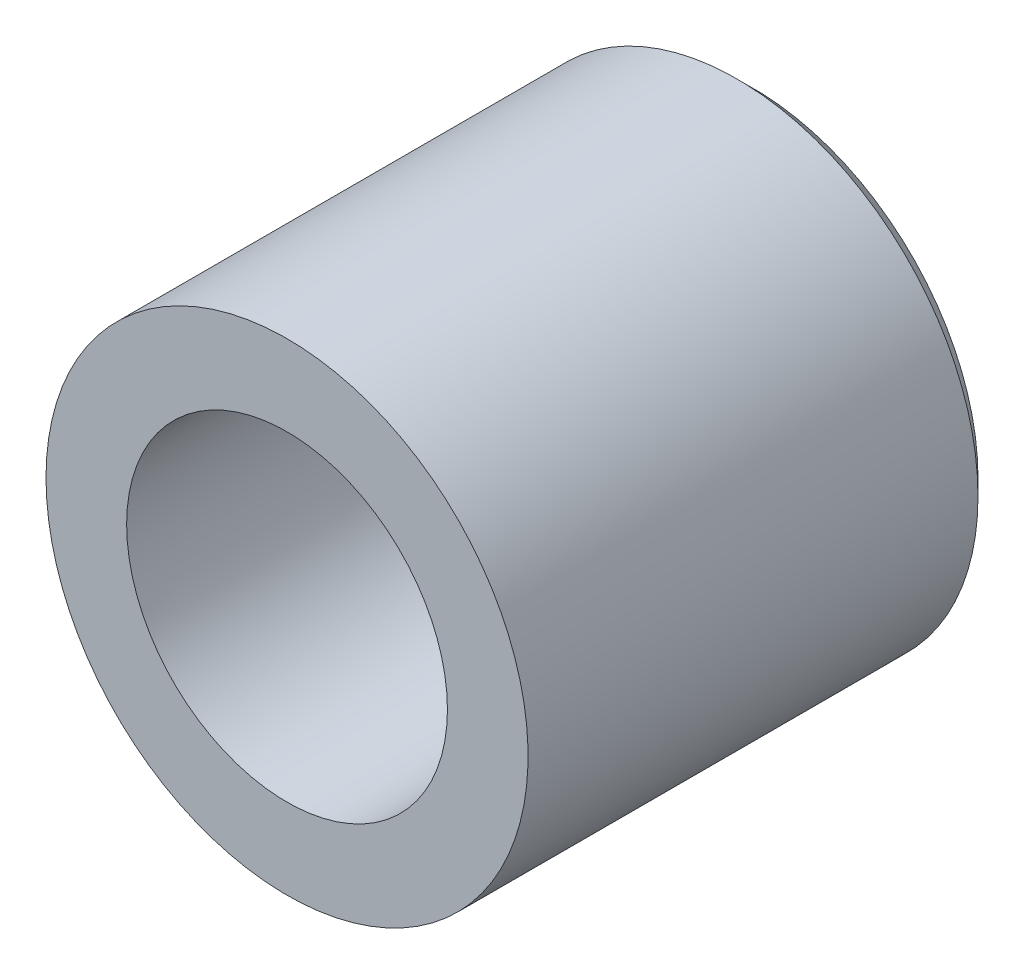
ISO-10303-21;
HEADER;
FILE_DESCRIPTION(('STEP AP214'),'2;1');
FILE_NAME('part.step','',(''),(''),'','','');
FILE_SCHEMA(('AUTOMOTIVE_DESIGN { 1 0 10303 214 1 1 1 1 }'));
ENDSEC;
DATA;
#1=APPLICATION_CONTEXT('core data for automotive mechanical design processes');
#2=APPLICATION_PROTOCOL_DEFINITION('international standard','automotive_design',2000,#1);
#3=PRODUCT_CONTEXT('',#1,'mechanical');
#4=PRODUCT('Part','Part','',(#3));
#5=PRODUCT_RELATED_PRODUCT_CATEGORY('part','',(#4));
#6=PRODUCT_DEFINITION_FORMATION('','',#4);
#7=PRODUCT_DEFINITION_CONTEXT('part definition',#1,'design');
#8=PRODUCT_DEFINITION('design','',#6,#7);
#9=PRODUCT_DEFINITION_SHAPE('','',#8);
#10=(LENGTH_UNIT() NAMED_UNIT(*) SI_UNIT(.MILLI.,.METRE.));
#11=(NAMED_UNIT(*) PLANE_ANGLE_UNIT() SI_UNIT($,.RADIAN.));
#12=(NAMED_UNIT(*) SI_UNIT($,.STERADIAN.) SOLID_ANGLE_UNIT());
#13=UNCERTAINTY_MEASURE_WITH_UNIT(LENGTH_MEASURE(1.E-05),#10,'distance_accuracy_value','');
#14=(GEOMETRIC_REPRESENTATION_CONTEXT(3) GLOBAL_UNCERTAINTY_ASSIGNED_CONTEXT((#13)) GLOBAL_UNIT_ASSIGNED_CONTEXT((#10,
#11,#12)) REPRESENTATION_CONTEXT('',''));
#15=CARTESIAN_POINT('',(0.,0.,0.));
#16=DIRECTION('',(0.,0.,1.));
#17=DIRECTION('',(1.,0.,0.));
#18=AXIS2_PLACEMENT_3D('',#15,#16,#17);
#19=CARTESIAN_POINT('',(0.,0.,-12.9663162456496));
#20=DIRECTION('',(0.,0.,1.));
#21=DIRECTION('',(1.,0.,0.));
#22=AXIS2_PLACEMENT_3D('',#19,#20,#21);
#23=CONICAL_SURFACE('',#22,13.7718577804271,0.785398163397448);
#24=CARTESIAN_POINT('',(-1.25693328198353E-13,0.,-18.));
#25=DIRECTION('',(0.,0.,1.));
#26=DIRECTION('',(-1.,0.,0.));
#27=AXIS2_PLACEMENT_3D('',#24,#25,#26);
#28=CIRCLE('',#27,8.73817402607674);
#29=CARTESIAN_POINT('',(8.73817402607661,0.,-18.));
#30=VERTEX_POINT('',#29);
#31=CARTESIAN_POINT('',(-8.73817402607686,0.,-18.));
#32=VERTEX_POINT('',#31);
#33=EDGE_CURVE('E143',#30,#32,#28,.T.);
#34=ORIENTED_EDGE('',*,*,#33,.F.);
#35=CARTESIAN_POINT('',(8.73817451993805,0.,-17.9999995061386));
#36=CARTESIAN_POINT('',(9.73817237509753,0.,-17.0000016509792));
#37=B_SPLINE_CURVE_WITH_KNOTS('',1,(#35,#36),.UNSPECIFIED.,.F.,.F.,(2,2),(0.634494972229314,
0.70710666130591),.UNSPECIFIED.);
#38=CARTESIAN_POINT('',(9.73817402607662,0.,-17.));
#39=VERTEX_POINT('',#38);
#40=EDGE_CURVE('E44',#30,#39,#37,.T.);
#41=ORIENTED_EDGE('',*,*,#40,.T.);
#42=CARTESIAN_POINT('',(-1.18710365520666E-13,0.,-17.));
#43=DIRECTION('',(0.,0.,-1.));
#44=DIRECTION('',(-1.,0.,0.));
#45=AXIS2_PLACEMENT_3D('',#42,#43,#44);
#46=CIRCLE('',#45,9.73817402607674);
#47=CARTESIAN_POINT('',(-9.73817402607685,0.,-17.));
#48=VERTEX_POINT('',#47);
#49=EDGE_CURVE('E11',#48,#39,#46,.T.);
#50=ORIENTED_EDGE('',*,*,#49,.F.);
#51=CARTESIAN_POINT('',(-1.18710365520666E-13,0.,-17.));
#52=DIRECTION('',(0.,0.,-1.));
#53=DIRECTION('',(-1.,0.,0.));
#54=AXIS2_PLACEMENT_3D('',#51,#52,#53);
#55=CIRCLE('',#54,9.73817402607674);
#56=EDGE_CURVE('E51',#39,#48,#55,.T.);
#57=ORIENTED_EDGE('',*,*,#56,.F.);
#58=ORIENTED_EDGE('',*,*,#40,.F.);
#59=CARTESIAN_POINT('',(-1.25693328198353E-13,0.,-18.));
#60=DIRECTION('',(0.,0.,1.));
#61=DIRECTION('',(-1.,0.,0.));
#62=AXIS2_PLACEMENT_3D('',#59,#60,#61);
#63=CIRCLE('',#62,8.73817402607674);
#64=EDGE_CURVE('E59',#32,#30,#63,.T.);
#65=ORIENTED_EDGE('',*,*,#64,.F.);
#66=EDGE_LOOP('',(#34,#41,#50,#57,#58,#65));
#67=FACE_BOUND('',#66,.T.);
#68=ADVANCED_FACE('F36',(#67),#23,.F.);
#69=CARTESIAN_POINT('',(-1.15218884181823E-13,0.,-16.5));
#70=DIRECTION('',(0.,0.,-1.));
#71=DIRECTION('',(-1.,0.,0.));
#72=AXIS2_PLACEMENT_3D('',#69,#70,#71);
#73=CYLINDRICAL_SURFACE('',#72,9.73817402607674);
#74=CARTESIAN_POINT('',(-1.04744440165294E-13,0.,-15.));
#75=DIRECTION('',(0.,0.,-1.));
#76=DIRECTION('',(-1.,0.,0.));
#77=AXIS2_PLACEMENT_3D('',#74,#75,#76);
#78=CIRCLE('',#77,9.73817402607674);
#79=CARTESIAN_POINT('',(-9.73817402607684,0.,-15.));
#80=VERTEX_POINT('',#79);
#81=EDGE_CURVE('E152',#80,#80,#78,.T.);
#82=ORIENTED_EDGE('',*,*,#81,.F.);
#83=CARTESIAN_POINT('',(-9.73817402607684,0.,-14.9999969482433));
#84=CARTESIAN_POINT('',(-9.73817402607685,0.,-17.0000020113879));
#85=B_SPLINE_CURVE_WITH_KNOTS('',1,(#83,#84),.UNSPECIFIED.,.F.,.F.,(2,2),(0.0833320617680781,
0.91666750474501),.UNSPECIFIED.);
#86=EDGE_CURVE('E147',#80,#48,#85,.T.);
#87=ORIENTED_EDGE('',*,*,#86,.T.);
#88=ORIENTED_EDGE('',*,*,#49,.T.);
#89=ORIENTED_EDGE('',*,*,#56,.T.);
#90=ORIENTED_EDGE('',*,*,#86,.F.);
#91=EDGE_LOOP('',(#82,#87,#88,#89,#90));
#92=FACE_BOUND('',#91,.T.);
#93=ADVANCED_FACE('F191',(#92),#73,.F.);
#94=CARTESIAN_POINT('',(20.0978002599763,-18.1619536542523,-18.));
#95=DIRECTION('',(0.,0.,-1.));
#96=DIRECTION('',(-1.,0.,0.));
#97=AXIS2_PLACEMENT_3D('',#94,#95,#96);
#98=PLANE('',#97);
#99=CARTESIAN_POINT('',(-2.09488880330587E-13,0.,-17.9999999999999));
#100=DIRECTION('',(0.,0.,-1.));
#101=DIRECTION('',(-1.,0.,0.));
#102=AXIS2_PLACEMENT_3D('',#99,#100,#101);
#103=CIRCLE('',#102,4.24999999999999);
#104=CARTESIAN_POINT('',(-4.2500000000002,0.,-17.9999999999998));
#105=VERTEX_POINT('',#104);
#106=EDGE_CURVE('E103',#105,#105,#103,.T.);
#107=ORIENTED_EDGE('',*,*,#106,.T.);
#108=EDGE_LOOP('',(#107));
#109=FACE_BOUND('',#108,.T.);
#110=ORIENTED_EDGE('',*,*,#64,.T.);
#111=ORIENTED_EDGE('',*,*,#33,.T.);
#112=EDGE_LOOP('',(#110,#111));
#113=FACE_BOUND('',#112,.T.);
#114=ADVANCED_FACE('F193',(#109,#113),#98,.F.);
#115=CARTESIAN_POINT('',(0.,0.,-1.));
#116=DIRECTION('',(0.,0.,1.));
#117=DIRECTION('',(-1.,0.,0.));
#118=AXIS2_PLACEMENT_3D('',#115,#116,#117);
#119=CONICAL_SURFACE('',#118,9.98254493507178,0.0174532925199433);
#120=ORIENTED_EDGE('',*,*,#81,.T.);
#121=CARTESIAN_POINT('',(-9.73817402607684,0.,-15.));
#122=CARTESIAN_POINT('',(-9.98254493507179,0.,-0.99999999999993));
#123=B_SPLINE_CURVE_WITH_KNOTS('',1,(#121,#122),.UNSPECIFIED.,.F.,.F.,(2,2),(0.,1.),.UNSPECIFIED.);
#124=CARTESIAN_POINT('',(-9.98254493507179,0.,-0.99999999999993));
#125=VERTEX_POINT('',#124);
#126=EDGE_CURVE('E108',#80,#125,#123,.T.);
#127=ORIENTED_EDGE('',*,*,#126,.T.);
#128=CARTESIAN_POINT('',(0.,0.,-1.));
#129=DIRECTION('',(0.,0.,-1.));
#130=DIRECTION('',(1.,0.,0.));
#131=AXIS2_PLACEMENT_3D('',#128,#129,#130);
#132=CIRCLE('',#131,9.98254493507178);
#133=CARTESIAN_POINT('',(9.98254493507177,0.,-1.00000000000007));
#134=VERTEX_POINT('',#133);
#135=EDGE_CURVE('E133',#134,#125,#132,.T.);
#136=ORIENTED_EDGE('',*,*,#135,.F.);
#137=CARTESIAN_POINT('',(0.,0.,-1.));
#138=DIRECTION('',(0.,0.,-1.));
#139=DIRECTION('',(1.,0.,0.));
#140=AXIS2_PLACEMENT_3D('',#137,#138,#139);
#141=CIRCLE('',#140,9.98254493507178);
#142=EDGE_CURVE('E126',#125,#134,#141,.T.);
#143=ORIENTED_EDGE('',*,*,#142,.F.);
#144=ORIENTED_EDGE('',*,*,#126,.F.);
#145=EDGE_LOOP('',(#120,#127,#136,#143,#144));
#146=FACE_BOUND('',#145,.T.);
#147=ADVANCED_FACE('F189',(#146),#119,.F.);
#148=CARTESIAN_POINT('',(-1.5911934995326E-13,0.,-22.7867965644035));
#149=DIRECTION('',(0.,0.,1.));
#150=DIRECTION('',(1.,0.,0.));
#151=AXIS2_PLACEMENT_3D('',#148,#149,#150);
#152=CONICAL_SURFACE('',#151,21.2132034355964,0.785398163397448);
#153=CARTESIAN_POINT('',(-2.09488880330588E-13,0.,-30.));
#154=DIRECTION('',(0.,0.,1.));
#155=DIRECTION('',(-1.,0.,0.));
#156=AXIS2_PLACEMENT_3D('',#153,#154,#155);
#157=CIRCLE('',#156,14.);
#158=CARTESIAN_POINT('',(-14.0000000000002,0.,-30.));
#159=VERTEX_POINT('',#158);
#160=CARTESIAN_POINT('',(13.9999999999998,0.,-30.));
#161=VERTEX_POINT('',#160);
#162=EDGE_CURVE('E90',#159,#161,#157,.T.);
#163=ORIENTED_EDGE('',*,*,#162,.T.);
#164=CARTESIAN_POINT('',(14.0000009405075,0.,-29.9999990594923));
#165=CARTESIAN_POINT('',(15.0000023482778,0.,-28.9999976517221));
#166=B_SPLINE_CURVE_WITH_KNOTS('',1,(#164,#165),.UNSPECIFIED.,.F.,.F.,(2,2),(0.659966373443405,
0.707106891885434),.UNSPECIFIED.);
#167=CARTESIAN_POINT('',(14.9999999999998,0.,-29.));
#168=VERTEX_POINT('',#167);
#169=EDGE_CURVE('E95',#161,#168,#166,.T.);
#170=ORIENTED_EDGE('',*,*,#169,.T.);
#171=CARTESIAN_POINT('',(-2.02505917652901E-13,0.,-29.));
#172=DIRECTION('',(0.,0.,-1.));
#173=DIRECTION('',(-1.,0.,0.));
#174=AXIS2_PLACEMENT_3D('',#171,#172,#173);
#175=CIRCLE('',#174,15.);
#176=CARTESIAN_POINT('',(-15.,0.,-29.));
#177=VERTEX_POINT('',#176);
#178=EDGE_CURVE('E102',#168,#177,#175,.T.);
#179=ORIENTED_EDGE('',*,*,#178,.T.);
#180=CARTESIAN_POINT('',(-2.02505917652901E-13,0.,-29.));
#181=DIRECTION('',(0.,0.,-1.));
#182=DIRECTION('',(-1.,0.,0.));
#183=AXIS2_PLACEMENT_3D('',#180,#181,#182);
#184=CIRCLE('',#183,15.);
#185=EDGE_CURVE('E105',#177,#168,#184,.T.);
#186=ORIENTED_EDGE('',*,*,#185,.T.);
#187=ORIENTED_EDGE('',*,*,#169,.F.);
#188=CARTESIAN_POINT('',(-2.09488880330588E-13,0.,-30.));
#189=DIRECTION('',(0.,0.,1.));
#190=DIRECTION('',(-1.,0.,0.));
#191=AXIS2_PLACEMENT_3D('',#188,#189,#190);
#192=CIRCLE('',#191,14.);
#193=EDGE_CURVE('E97',#161,#159,#192,.T.);
#194=ORIENTED_EDGE('',*,*,#193,.T.);
#195=EDGE_LOOP('',(#163,#170,#179,#186,#187,#194));
#196=FACE_BOUND('',#195,.T.);
#197=ADVANCED_FACE('F92',(#196),#152,.T.);
#198=CARTESIAN_POINT('',(-1.08235921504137E-13,0.,-15.5));
#199=DIRECTION('',(0.,0.,-1.));
#200=DIRECTION('',(-1.,0.,0.));
#201=AXIS2_PLACEMENT_3D('',#198,#199,#200);
#202=CYLINDRICAL_SURFACE('',#201,15.);
#203=CARTESIAN_POINT('',(0.,0.,-1.));
#204=DIRECTION('',(0.,0.,1.));
#205=DIRECTION('',(-1.,0.,0.));
#206=AXIS2_PLACEMENT_3D('',#203,#204,#205);
#207=CIRCLE('',#206,15.);
#208=CARTESIAN_POINT('',(-15.,0.,-0.999999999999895));
#209=VERTEX_POINT('',#208);
#210=EDGE_CURVE('E99',#209,#209,#207,.T.);
#211=ORIENTED_EDGE('',*,*,#210,.F.);
#212=CARTESIAN_POINT('',(-15.,0.,-0.99999893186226));
#213=CARTESIAN_POINT('',(-15.,0.,-28.9999996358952));
#214=B_SPLINE_CURVE_WITH_KNOTS('',1,(#212,#213),.UNSPECIFIED.,.F.,.F.,(2,2),(0.0833333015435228,
0.916666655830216),.UNSPECIFIED.);
#215=EDGE_CURVE('E173',#209,#177,#214,.T.);
#216=ORIENTED_EDGE('',*,*,#215,.T.);
#217=ORIENTED_EDGE('',*,*,#178,.F.);
#218=ORIENTED_EDGE('',*,*,#185,.F.);
#219=ORIENTED_EDGE('',*,*,#215,.F.);
#220=EDGE_LOOP('',(#211,#216,#217,#218,#219));
#221=FACE_BOUND('',#220,.T.);
#222=ADVANCED_FACE('F225',(#221),#202,.T.);
#223=CARTESIAN_POINT('',(32.2,-29.0984535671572,-30.));
#224=DIRECTION('',(0.,0.,-1.));
#225=DIRECTION('',(-1.,0.,0.));
#226=AXIS2_PLACEMENT_3D('',#223,#224,#225);
#227=PLANE('',#226);
#228=CARTESIAN_POINT('',(-2.09488880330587E-13,0.,-29.9999999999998));
#229=DIRECTION('',(0.,0.,-1.));
#230=DIRECTION('',(-1.,0.,0.));
#231=AXIS2_PLACEMENT_3D('',#228,#229,#230);
#232=CIRCLE('',#231,4.24999999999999);
#233=CARTESIAN_POINT('',(-4.2500000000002,0.,-29.9999999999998));
#234=VERTEX_POINT('',#233);
#235=EDGE_CURVE('E275',#234,#234,#232,.T.);
#236=ORIENTED_EDGE('',*,*,#235,.F.);
#237=EDGE_LOOP('',(#236));
#238=FACE_BOUND('',#237,.T.);
#239=ORIENTED_EDGE('',*,*,#193,.F.);
#240=ORIENTED_EDGE('',*,*,#162,.F.);
#241=EDGE_LOOP('',(#239,#240));
#242=FACE_BOUND('',#241,.T.);
#243=ADVANCED_FACE('F101',(#238,#242),#227,.T.);
#244=CARTESIAN_POINT('',(-19.5,-31.1769145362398,-0.999999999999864));
#245=DIRECTION('',(0.,0.,1.));
#246=DIRECTION('',(1.,0.,0.));
#247=AXIS2_PLACEMENT_3D('',#244,#245,#246);
#248=PLANE('',#247);
#249=ORIENTED_EDGE('',*,*,#210,.T.);
#250=EDGE_LOOP('',(#249));
#251=FACE_BOUND('',#250,.T.);
#252=ORIENTED_EDGE('',*,*,#135,.T.);
#253=ORIENTED_EDGE('',*,*,#142,.T.);
#254=EDGE_LOOP('',(#252,#253));
#255=FACE_BOUND('',#254,.T.);
#256=ADVANCED_FACE('F240',(#251,#255),#248,.T.);
#257=CARTESIAN_POINT('',(-2.09488880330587E-13,0.,-29.9999999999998));
#258=DIRECTION('',(0.,0.,-1.));
#259=DIRECTION('',(-1.,0.,0.));
#260=AXIS2_PLACEMENT_3D('',#257,#258,#259);
#261=CYLINDRICAL_SURFACE('',#260,4.24999999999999);
#262=ORIENTED_EDGE('',*,*,#235,.T.);
#263=EDGE_LOOP('',(#262));
#264=FACE_BOUND('',#263,.T.);
#265=ORIENTED_EDGE('',*,*,#106,.F.);
#266=EDGE_LOOP('',(#265));
#267=FACE_BOUND('',#266,.T.);
#268=ADVANCED_FACE('F248',(#264,#267),#261,.F.);
#269=CLOSED_SHELL('',(#68,#93,#114,#147,#197,#222,#243,#256,#268));
#270=MANIFOLD_SOLID_BREP('B2',#269);
#271=ADVANCED_BREP_SHAPE_REPRESENTATION('',(#18,#270),#14);
#272=SHAPE_DEFINITION_REPRESENTATION(#9,#271);
ENDSEC;
END-ISO-10303-21;
